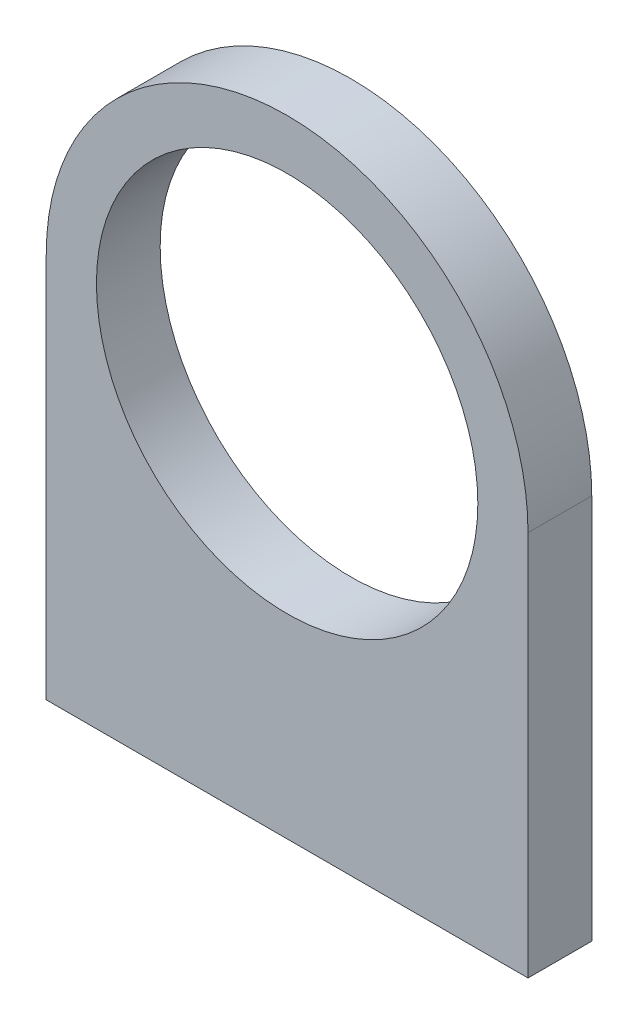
ISO-10303-21;
HEADER;
FILE_DESCRIPTION(('STEP AP214'),'2;1');
FILE_NAME('part.step','',(''),(''),'','','');
FILE_SCHEMA(('AUTOMOTIVE_DESIGN { 1 0 10303 214 1 1 1 1 }'));
ENDSEC;
DATA;
#1=APPLICATION_CONTEXT('core data for automotive mechanical design processes');
#2=APPLICATION_PROTOCOL_DEFINITION('international standard','automotive_design',2000,#1);
#3=PRODUCT_CONTEXT('',#1,'mechanical');
#4=PRODUCT('Part','Part','',(#3));
#5=PRODUCT_RELATED_PRODUCT_CATEGORY('part','',(#4));
#6=PRODUCT_DEFINITION_FORMATION('','',#4);
#7=PRODUCT_DEFINITION_CONTEXT('part definition',#1,'design');
#8=PRODUCT_DEFINITION('design','',#6,#7);
#9=PRODUCT_DEFINITION_SHAPE('','',#8);
#10=(LENGTH_UNIT() NAMED_UNIT(*) SI_UNIT(.MILLI.,.METRE.));
#11=(NAMED_UNIT(*) PLANE_ANGLE_UNIT() SI_UNIT($,.RADIAN.));
#12=(NAMED_UNIT(*) SI_UNIT($,.STERADIAN.) SOLID_ANGLE_UNIT());
#13=UNCERTAINTY_MEASURE_WITH_UNIT(LENGTH_MEASURE(1.E-05),#10,'distance_accuracy_value','');
#14=(GEOMETRIC_REPRESENTATION_CONTEXT(3) GLOBAL_UNCERTAINTY_ASSIGNED_CONTEXT((#13)) GLOBAL_UNIT_ASSIGNED_CONTEXT((#10,
#11,#12)) REPRESENTATION_CONTEXT('',''));
#15=CARTESIAN_POINT('',(0.,0.,0.));
#16=DIRECTION('',(0.,0.,1.));
#17=DIRECTION('',(1.,0.,0.));
#18=AXIS2_PLACEMENT_3D('',#15,#16,#17);
#19=CARTESIAN_POINT('',(24.,38.425,6.35));
#20=DIRECTION('',(0.,0.,-1.));
#21=DIRECTION('',(-1.,0.,0.));
#22=AXIS2_PLACEMENT_3D('',#19,#20,#21);
#23=PLANE('',#22);
#24=DIRECTION('',(0.,-1.,0.));
#25=VECTOR('',#24,1.);
#26=CARTESIAN_POINT('',(0.,0.,6.35));
#27=LINE('',#26,#25);
#28=CARTESIAN_POINT('',(0.,38.425,6.35));
#29=VERTEX_POINT('',#28);
#30=CARTESIAN_POINT('',(0.,0.,6.35));
#31=VERTEX_POINT('',#30);
#32=EDGE_CURVE('E85',#29,#31,#27,.T.);
#33=ORIENTED_EDGE('',*,*,#32,.T.);
#34=DIRECTION('',(1.,0.,0.));
#35=VECTOR('',#34,1.);
#36=CARTESIAN_POINT('',(0.,0.,6.35));
#37=LINE('',#36,#35);
#38=CARTESIAN_POINT('',(48.,0.,6.35));
#39=VERTEX_POINT('',#38);
#40=EDGE_CURVE('E80',#31,#39,#37,.T.);
#41=ORIENTED_EDGE('',*,*,#40,.T.);
#42=DIRECTION('',(0.,1.,0.));
#43=VECTOR('',#42,1.);
#44=CARTESIAN_POINT('',(48.,0.,6.35));
#45=LINE('',#44,#43);
#46=CARTESIAN_POINT('',(48.,38.425,6.35));
#47=VERTEX_POINT('',#46);
#48=EDGE_CURVE('E83',#39,#47,#45,.T.);
#49=ORIENTED_EDGE('',*,*,#48,.T.);
#50=CARTESIAN_POINT('',(24.,38.425,6.35));
#51=DIRECTION('',(0.,0.,1.));
#52=DIRECTION('',(-1.,0.,0.));
#53=AXIS2_PLACEMENT_3D('',#50,#51,#52);
#54=CIRCLE('',#53,24.);
#55=EDGE_CURVE('E50',#47,#29,#54,.T.);
#56=ORIENTED_EDGE('',*,*,#55,.T.);
#57=EDGE_LOOP('',(#33,#41,#49,#56));
#58=FACE_BOUND('',#57,.T.);
#59=CARTESIAN_POINT('',(24.,38.425,6.35));
#60=DIRECTION('',(0.,0.,1.));
#61=DIRECTION('',(1.,0.,0.));
#62=AXIS2_PLACEMENT_3D('',#59,#60,#61);
#63=CIRCLE('',#62,19.);
#64=CARTESIAN_POINT('',(43.,38.425,6.35));
#65=VERTEX_POINT('',#64);
#66=EDGE_CURVE('E100',#65,#65,#63,.T.);
#67=ORIENTED_EDGE('',*,*,#66,.F.);
#68=EDGE_LOOP('',(#67));
#69=FACE_BOUND('',#68,.T.);
#70=ADVANCED_FACE('F33',(#58,#69),#23,.F.);
#71=CARTESIAN_POINT('',(24.,38.425,0.));
#72=DIRECTION('',(0.,0.,-1.));
#73=DIRECTION('',(-1.,0.,0.));
#74=AXIS2_PLACEMENT_3D('',#71,#72,#73);
#75=PLANE('',#74);
#76=DIRECTION('',(0.,-1.,0.));
#77=VECTOR('',#76,1.);
#78=CARTESIAN_POINT('',(0.,0.,0.));
#79=LINE('',#78,#77);
#80=CARTESIAN_POINT('',(0.,38.425,0.));
#81=VERTEX_POINT('',#80);
#82=CARTESIAN_POINT('',(0.,0.,0.));
#83=VERTEX_POINT('',#82);
#84=EDGE_CURVE('E97',#81,#83,#79,.T.);
#85=ORIENTED_EDGE('',*,*,#84,.F.);
#86=CARTESIAN_POINT('',(24.,38.425,0.));
#87=DIRECTION('',(0.,0.,1.));
#88=DIRECTION('',(-1.,0.,0.));
#89=AXIS2_PLACEMENT_3D('',#86,#87,#88);
#90=CIRCLE('',#89,24.);
#91=CARTESIAN_POINT('',(48.,38.425,0.));
#92=VERTEX_POINT('',#91);
#93=EDGE_CURVE('E73',#92,#81,#90,.T.);
#94=ORIENTED_EDGE('',*,*,#93,.F.);
#95=DIRECTION('',(0.,1.,0.));
#96=VECTOR('',#95,1.);
#97=CARTESIAN_POINT('',(48.,0.,0.));
#98=LINE('',#97,#96);
#99=CARTESIAN_POINT('',(48.,0.,0.));
#100=VERTEX_POINT('',#99);
#101=EDGE_CURVE('E67',#100,#92,#98,.T.);
#102=ORIENTED_EDGE('',*,*,#101,.F.);
#103=DIRECTION('',(1.,0.,0.));
#104=VECTOR('',#103,1.);
#105=CARTESIAN_POINT('',(0.,0.,0.));
#106=LINE('',#105,#104);
#107=EDGE_CURVE('E89',#83,#100,#106,.T.);
#108=ORIENTED_EDGE('',*,*,#107,.F.);
#109=EDGE_LOOP('',(#85,#94,#102,#108));
#110=FACE_BOUND('',#109,.T.);
#111=CARTESIAN_POINT('',(24.,38.425,0.));
#112=DIRECTION('',(0.,0.,1.));
#113=DIRECTION('',(1.,0.,0.));
#114=AXIS2_PLACEMENT_3D('',#111,#112,#113);
#115=CIRCLE('',#114,19.);
#116=CARTESIAN_POINT('',(43.,38.425,0.));
#117=VERTEX_POINT('',#116);
#118=EDGE_CURVE('E112',#117,#117,#115,.T.);
#119=ORIENTED_EDGE('',*,*,#118,.T.);
#120=EDGE_LOOP('',(#119));
#121=FACE_BOUND('',#120,.T.);
#122=ADVANCED_FACE('F108',(#110,#121),#75,.T.);
#123=CARTESIAN_POINT('',(0.,0.,6.35));
#124=DIRECTION('',(1.,0.,0.));
#125=DIRECTION('',(0.,1.,0.));
#126=AXIS2_PLACEMENT_3D('',#123,#124,#125);
#127=PLANE('',#126);
#128=ORIENTED_EDGE('',*,*,#84,.T.);
#129=DIRECTION('',(0.,0.,-1.));
#130=VECTOR('',#129,1.);
#131=CARTESIAN_POINT('',(0.,0.,6.35));
#132=LINE('',#131,#130);
#133=EDGE_CURVE('E11',#31,#83,#132,.T.);
#134=ORIENTED_EDGE('',*,*,#133,.F.);
#135=ORIENTED_EDGE('',*,*,#32,.F.);
#136=DIRECTION('',(0.,0.,-1.));
#137=VECTOR('',#136,1.);
#138=CARTESIAN_POINT('',(0.,38.425,6.35));
#139=LINE('',#138,#137);
#140=EDGE_CURVE('E93',#29,#81,#139,.T.);
#141=ORIENTED_EDGE('',*,*,#140,.T.);
#142=EDGE_LOOP('',(#128,#134,#135,#141));
#143=FACE_BOUND('',#142,.T.);
#144=ADVANCED_FACE('F35',(#143),#127,.F.);
#145=CARTESIAN_POINT('',(0.,0.,6.35));
#146=DIRECTION('',(0.,1.,0.));
#147=DIRECTION('',(-1.,0.,0.));
#148=AXIS2_PLACEMENT_3D('',#145,#146,#147);
#149=PLANE('',#148);
#150=ORIENTED_EDGE('',*,*,#107,.T.);
#151=DIRECTION('',(0.,0.,-1.));
#152=VECTOR('',#151,1.);
#153=CARTESIAN_POINT('',(48.,0.,6.35));
#154=LINE('',#153,#152);
#155=EDGE_CURVE('E42',#39,#100,#154,.T.);
#156=ORIENTED_EDGE('',*,*,#155,.F.);
#157=ORIENTED_EDGE('',*,*,#40,.F.);
#158=ORIENTED_EDGE('',*,*,#133,.T.);
#159=EDGE_LOOP('',(#150,#156,#157,#158));
#160=FACE_BOUND('',#159,.T.);
#161=ADVANCED_FACE('F88',(#160),#149,.F.);
#162=CARTESIAN_POINT('',(48.,0.,6.35));
#163=DIRECTION('',(-1.,0.,0.));
#164=DIRECTION('',(0.,-1.,0.));
#165=AXIS2_PLACEMENT_3D('',#162,#163,#164);
#166=PLANE('',#165);
#167=ORIENTED_EDGE('',*,*,#101,.T.);
#168=DIRECTION('',(0.,0.,-1.));
#169=VECTOR('',#168,1.);
#170=CARTESIAN_POINT('',(48.,38.425,6.35));
#171=LINE('',#170,#169);
#172=EDGE_CURVE('E90',#47,#92,#171,.T.);
#173=ORIENTED_EDGE('',*,*,#172,.F.);
#174=ORIENTED_EDGE('',*,*,#48,.F.);
#175=ORIENTED_EDGE('',*,*,#155,.T.);
#176=EDGE_LOOP('',(#167,#173,#174,#175));
#177=FACE_BOUND('',#176,.T.);
#178=ADVANCED_FACE('F91',(#177),#166,.F.);
#179=CARTESIAN_POINT('',(24.,38.425,6.35));
#180=DIRECTION('',(0.,0.,-1.));
#181=DIRECTION('',(-1.,0.,0.));
#182=AXIS2_PLACEMENT_3D('',#179,#180,#181);
#183=CYLINDRICAL_SURFACE('',#182,24.);
#184=ORIENTED_EDGE('',*,*,#93,.T.);
#185=ORIENTED_EDGE('',*,*,#140,.F.);
#186=ORIENTED_EDGE('',*,*,#55,.F.);
#187=ORIENTED_EDGE('',*,*,#172,.T.);
#188=EDGE_LOOP('',(#184,#185,#186,#187));
#189=FACE_BOUND('',#188,.T.);
#190=ADVANCED_FACE('F105',(#189),#183,.T.);
#191=CARTESIAN_POINT('',(24.,38.425,6.35));
#192=DIRECTION('',(0.,0.,-1.));
#193=DIRECTION('',(-1.,0.,0.));
#194=AXIS2_PLACEMENT_3D('',#191,#192,#193);
#195=CYLINDRICAL_SURFACE('',#194,19.);
#196=ORIENTED_EDGE('',*,*,#66,.T.);
#197=EDGE_LOOP('',(#196));
#198=FACE_BOUND('',#197,.T.);
#199=ORIENTED_EDGE('',*,*,#118,.F.);
#200=EDGE_LOOP('',(#199));
#201=FACE_BOUND('',#200,.T.);
#202=ADVANCED_FACE('F118',(#198,#201),#195,.F.);
#203=CLOSED_SHELL('',(#70,#122,#144,#161,#178,#190,#202));
#204=MANIFOLD_SOLID_BREP('B2',#203);
#205=ADVANCED_BREP_SHAPE_REPRESENTATION('',(#18,#204),#14);
#206=SHAPE_DEFINITION_REPRESENTATION(#9,#205);
ENDSEC;
END-ISO-10303-21;
